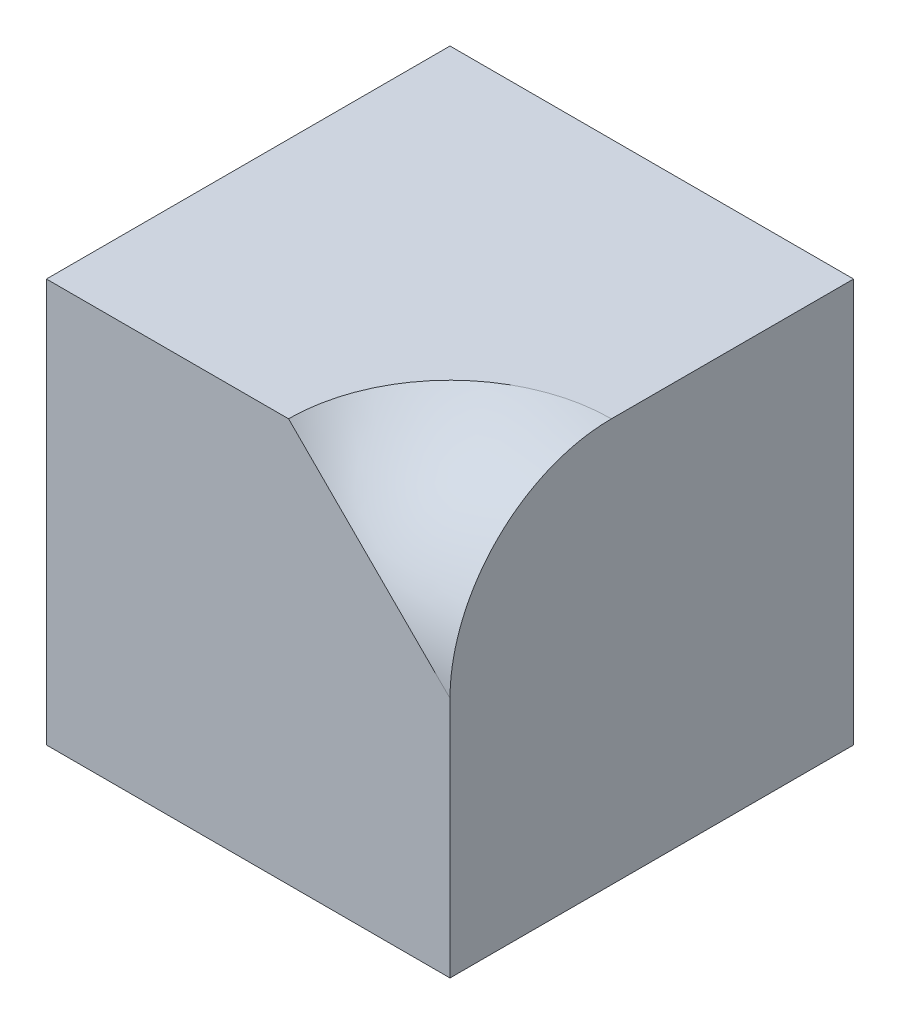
ISO-10303-21;
HEADER;
FILE_DESCRIPTION(('STEP AP214'),'2;1');
FILE_NAME('part.step','',(''),(''),'','','');
FILE_SCHEMA(('AUTOMOTIVE_DESIGN { 1 0 10303 214 1 1 1 1 }'));
ENDSEC;
DATA;
#1=APPLICATION_CONTEXT('core data for automotive mechanical design processes');
#2=APPLICATION_PROTOCOL_DEFINITION('international standard','automotive_design',2000,#1);
#3=PRODUCT_CONTEXT('',#1,'mechanical');
#4=PRODUCT('Part','Part','',(#3));
#5=PRODUCT_RELATED_PRODUCT_CATEGORY('part','',(#4));
#6=PRODUCT_DEFINITION_FORMATION('','',#4);
#7=PRODUCT_DEFINITION_CONTEXT('part definition',#1,'design');
#8=PRODUCT_DEFINITION('design','',#6,#7);
#9=PRODUCT_DEFINITION_SHAPE('','',#8);
#10=(LENGTH_UNIT() NAMED_UNIT(*) SI_UNIT(.MILLI.,.METRE.));
#11=(NAMED_UNIT(*) PLANE_ANGLE_UNIT() SI_UNIT($,.RADIAN.));
#12=(NAMED_UNIT(*) SI_UNIT($,.STERADIAN.) SOLID_ANGLE_UNIT());
#13=UNCERTAINTY_MEASURE_WITH_UNIT(LENGTH_MEASURE(1.E-05),#10,'distance_accuracy_value','');
#14=(GEOMETRIC_REPRESENTATION_CONTEXT(3) GLOBAL_UNCERTAINTY_ASSIGNED_CONTEXT((#13)) GLOBAL_UNIT_ASSIGNED_CONTEXT((#10,
#11,#12)) REPRESENTATION_CONTEXT('',''));
#15=CARTESIAN_POINT('',(0.,0.,0.));
#16=DIRECTION('',(0.,0.,1.));
#17=DIRECTION('',(1.,0.,0.));
#18=AXIS2_PLACEMENT_3D('',#15,#16,#17);
#19=CARTESIAN_POINT('',(50.,100.,50.));
#20=DIRECTION('',(-1.,0.,0.));
#21=DIRECTION('',(0.,0.,1.));
#22=AXIS2_PLACEMENT_3D('',#19,#20,#21);
#23=PLANE('',#22);
#24=CARTESIAN_POINT('',(50.0001212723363,100.000000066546,10.0985444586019));
#25=CARTESIAN_POINT('',(50.0001225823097,100.000006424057,10.0964960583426));
#26=CARTESIAN_POINT('',(50.0001238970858,100.000012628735,10.094447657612));
#27=CARTESIAN_POINT('',(50.000126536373,100.000024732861,10.0903507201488));
#28=CARTESIAN_POINT('',(50.0001278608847,100.00003063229,10.0883021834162));
#29=CARTESIAN_POINT('',(50.0001305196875,100.000042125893,10.0842049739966));
#30=CARTESIAN_POINT('',(50.0001318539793,100.000047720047,10.0821563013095));
#31=CARTESIAN_POINT('',(50.0001345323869,100.000058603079,10.0780588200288));
#32=CARTESIAN_POINT('',(50.0001358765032,100.000063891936,10.076010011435));
#33=CARTESIAN_POINT('',(50.0001385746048,100.000074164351,10.071912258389));
#34=CARTESIAN_POINT('',(50.0001399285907,100.000079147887,10.0698633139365));
#35=CARTESIAN_POINT('',(50.000142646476,100.000088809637,10.0657652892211));
#36=CARTESIAN_POINT('',(50.0001440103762,100.000093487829,10.0637162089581));
#37=CARTESIAN_POINT('',(50.0001467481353,100.000102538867,10.0596179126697));
#38=CARTESIAN_POINT('',(50.0001481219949,100.000106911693,10.0575686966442));
#39=CARTESIAN_POINT('',(50.0001508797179,100.000115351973,10.0534701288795));
#40=CARTESIAN_POINT('',(50.0001522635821,100.000119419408,10.0514207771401));
#41=CARTESIAN_POINT('',(50.0001550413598,100.000127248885,10.0473219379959));
#42=CARTESIAN_POINT('',(50.000156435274,100.000131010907,10.0452724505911));
#43=CARTESIAN_POINT('',(50.0001592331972,100.000138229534,10.0411733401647));
#44=CARTESIAN_POINT('',(50.0001606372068,100.00014168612,10.0391237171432));
#45=CARTESIAN_POINT('',(50.0001634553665,100.000148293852,10.0350243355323));
#46=CARTESIAN_POINT('',(50.0001648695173,100.000151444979,10.0329745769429));
#47=CARTESIAN_POINT('',(50.0001677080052,100.000157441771,10.0288749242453));
#48=CARTESIAN_POINT('',(50.0001691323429,100.000160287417,10.026825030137));
#49=CARTESIAN_POINT('',(50.0001719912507,100.000165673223,10.0227251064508));
#50=CARTESIAN_POINT('',(50.0001734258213,100.000168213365,10.0206750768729));
#51=CARTESIAN_POINT('',(50.000176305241,100.000172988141,10.0165748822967));
#52=CARTESIAN_POINT('',(50.0001777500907,100.000175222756,10.0145247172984));
#53=CARTESIAN_POINT('',(50.0001806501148,100.000179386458,10.010424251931));
#54=CARTESIAN_POINT('',(50.0001821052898,100.000181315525,10.0083739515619));
#55=CARTESIAN_POINT('',(50.0001850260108,100.000184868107,10.0042732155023));
#56=CARTESIAN_POINT('',(50.0001864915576,100.000186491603,10.002222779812));
#57=CARTESIAN_POINT('',(50.0001879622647,100.000187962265,10.0001723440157));
#58=B_SPLINE_CURVE_WITH_KNOTS('',3,(#24,#25,#26,#27,#28,#29,#30,#31,#32,#33,#34,#35,#36,#37,#38,
#39,#40,#41,#42,#43,#44,#45,#46,#47,#48,#49,#50,#51,#52,#53,#54,#55,#56,#57),.UNSPECIFIED.,.F.,
.F.,(4,2,2,2,2,2,2,2,2,2,2,2,2,2,2,2,4),(0.,0.00614523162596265,0.0122908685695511,
0.0184369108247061,0.024583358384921,0.0307302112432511,0.036877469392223,0.0430251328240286,
0.0491732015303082,0.0553216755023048,0.0614705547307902,0.0676198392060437,0.0737695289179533,
0.0799196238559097,0.0860701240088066,0.0922210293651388,0.0983723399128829),.UNSPECIFIED.);
#59=CARTESIAN_POINT('',(50.0000606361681,99.999939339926,10.0985442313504));
#60=VERTEX_POINT('',#59);
#61=CARTESIAN_POINT('',(50.0000469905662,100.000046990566,10.0000430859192));
#62=VERTEX_POINT('',#61);
#63=EDGE_CURVE('E63',#60,#62,#58,.T.);
#64=ORIENTED_EDGE('',*,*,#63,.F.);
#65=CARTESIAN_POINT('',(50.0001750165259,60.1134886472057,49.9999998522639));
#66=CARTESIAN_POINT('',(49.999757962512,60.4900635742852,49.9985452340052));
#67=CARTESIAN_POINT('',(49.9995670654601,60.8666238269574,49.9919720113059));
#68=CARTESIAN_POINT('',(49.9994404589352,61.6145533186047,49.9685831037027));
#69=CARTESIAN_POINT('',(49.9995014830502,61.9859267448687,49.9519009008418));
#70=CARTESIAN_POINT('',(49.9996798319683,62.7232853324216,49.9085389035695));
#71=CARTESIAN_POINT('',(49.999796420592,63.0892782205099,49.8819908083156));
#72=CARTESIAN_POINT('',(50.0000135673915,63.8157875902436,49.8192273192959));
#73=CARTESIAN_POINT('',(50.0001143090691,64.1763149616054,49.7831379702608));
#74=CARTESIAN_POINT('',(50.0002706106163,64.8918760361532,49.7016373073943));
#75=CARTESIAN_POINT('',(50.0003267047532,65.24692325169,49.6563446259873));
#76=CARTESIAN_POINT('',(50.0003942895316,65.951547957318,49.556784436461));
#77=CARTESIAN_POINT('',(50.0004062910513,66.3011410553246,49.5026273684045));
#78=CARTESIAN_POINT('',(50.0003974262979,66.9949040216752,49.3856718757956));
#79=CARTESIAN_POINT('',(50.0003769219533,67.3390911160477,49.3229756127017));
#80=CARTESIAN_POINT('',(50.0003177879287,68.0220987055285,49.1892553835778));
#81=CARTESIAN_POINT('',(50.0002793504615,68.3609376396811,49.1183255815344));
#82=CARTESIAN_POINT('',(50.0001972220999,69.0333077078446,48.9684292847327));
#83=CARTESIAN_POINT('',(50.0001535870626,69.3668581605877,48.889549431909));
#84=CARTESIAN_POINT('',(50.0000701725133,70.0287070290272,48.7240213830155));
#85=CARTESIAN_POINT('',(50.0000303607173,70.3570253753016,48.6374528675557));
#86=CARTESIAN_POINT('',(49.9999596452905,71.0084592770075,48.4567946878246));
#87=CARTESIAN_POINT('',(49.9999286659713,71.3315951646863,48.3627783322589));
#88=CARTESIAN_POINT('',(49.9998772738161,71.9727044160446,48.1674529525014));
#89=CARTESIAN_POINT('',(49.9998567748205,72.2906983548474,48.0662114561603));
#90=CARTESIAN_POINT('',(49.99982595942,72.9215531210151,47.8566485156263));
#91=CARTESIAN_POINT('',(49.9998155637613,73.2344346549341,47.7483894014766));
#92=CARTESIAN_POINT('',(49.9998036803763,73.8550816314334,47.5249914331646));
#93=CARTESIAN_POINT('',(49.9998021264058,74.162867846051,47.4099102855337));
#94=CARTESIAN_POINT('',(49.9998090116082,74.7733279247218,47.1730591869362));
#95=CARTESIAN_POINT('',(49.99981737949,75.0760226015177,47.0513428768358));
#96=CARTESIAN_POINT('',(49.9998427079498,75.6763010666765,46.8014015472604));
#97=CARTESIAN_POINT('',(49.999859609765,75.973905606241,46.6732263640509));
#98=CARTESIAN_POINT('',(49.99989650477,76.5640132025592,46.4105333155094));
#99=CARTESIAN_POINT('',(49.9999164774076,76.8565367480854,46.2760614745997));
#100=CARTESIAN_POINT('',(49.9999558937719,77.4364944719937,46.0009292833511));
#101=CARTESIAN_POINT('',(49.9999753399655,77.7239487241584,45.8603112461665));
#102=CARTESIAN_POINT('',(50.0000106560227,78.2937816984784,45.5730298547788));
#103=CARTESIAN_POINT('',(50.0000265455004,78.5761799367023,45.4264052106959));
#104=CARTESIAN_POINT('',(50.0000526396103,79.1359157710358,45.1272435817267));
#105=CARTESIAN_POINT('',(50.000062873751,79.4132721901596,44.9747418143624));
#106=CARTESIAN_POINT('',(50.0000764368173,79.9629396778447,44.6639494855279));
#107=CARTESIAN_POINT('',(50.0000797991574,80.2352687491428,44.5056907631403));
#108=CARTESIAN_POINT('',(50.0000793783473,80.7748966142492,44.1834994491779));
#109=CARTESIAN_POINT('',(50.000075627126,81.0422124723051,44.0195954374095));
#110=CARTESIAN_POINT('',(50.000061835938,81.571828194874,43.6862207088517));
#111=CARTESIAN_POINT('',(50.0000518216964,81.8341440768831,43.5167754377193));
#112=CARTESIAN_POINT('',(50.0000275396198,82.353772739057,43.1724184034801));
#113=CARTESIAN_POINT('',(50.0000132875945,82.6111003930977,42.9975290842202));
#114=CARTESIAN_POINT('',(49.9999841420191,83.120763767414,42.6423783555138));
#115=CARTESIAN_POINT('',(49.9999692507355,83.3731131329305,42.4621365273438));
#116=CARTESIAN_POINT('',(49.9999433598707,83.8728281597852,42.0963694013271));
#117=CARTESIAN_POINT('',(49.99993234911,84.120206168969,41.9108609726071));
#118=CARTESIAN_POINT('',(49.999923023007,84.6099858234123,41.5346477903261));
#119=CARTESIAN_POINT('',(49.9999246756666,84.8523984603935,41.3439573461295));
#120=CARTESIAN_POINT('',(49.9999388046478,85.3322393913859,40.9574518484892));
#121=CARTESIAN_POINT('',(49.9999512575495,85.5696773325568,40.7616487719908));
#122=CARTESIAN_POINT('',(49.999978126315,86.0395478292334,40.3649789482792));
#123=CARTESIAN_POINT('',(49.9999925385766,86.2719886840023,40.1641220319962));
#124=CARTESIAN_POINT('',(50.0000189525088,86.7318412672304,39.7574063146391));
#125=CARTESIAN_POINT('',(50.0000309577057,86.9592599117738,39.5515553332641));
#126=CARTESIAN_POINT('',(50.0000499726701,87.4090389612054,39.1349122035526));
#127=CARTESIAN_POINT('',(50.0000569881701,87.6314048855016,38.9241260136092));
#128=CARTESIAN_POINT('',(50.0000670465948,88.0710442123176,38.4976738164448));
#129=CARTESIAN_POINT('',(50.0000700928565,88.2883217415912,38.2820120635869));
#130=CARTESIAN_POINT('',(50.0000734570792,88.7177472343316,37.8458683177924));
#131=CARTESIAN_POINT('',(50.0000737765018,88.9298978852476,37.6253889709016));
#132=CARTESIAN_POINT('',(50.0000694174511,89.3490338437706,37.1796632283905));
#133=CARTESIAN_POINT('',(50.0000647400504,89.5560202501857,36.9544178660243));
#134=CARTESIAN_POINT('',(50.0000508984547,89.9647910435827,36.4992084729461));
#135=CARTESIAN_POINT('',(50.0000417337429,90.1665748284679,36.2692439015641));
#136=CARTESIAN_POINT('',(50.0000205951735,90.5649017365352,35.8046398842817));
#137=CARTESIAN_POINT('',(50.0000086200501,90.7614424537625,35.5699983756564));
#138=CARTESIAN_POINT('',(49.9999845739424,91.1492417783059,35.0960796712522));
#139=CARTESIAN_POINT('',(49.9999725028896,91.3404960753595,34.8567989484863));
#140=CARTESIAN_POINT('',(49.9999515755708,91.7176775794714,34.3736364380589));
#141=CARTESIAN_POINT('',(49.999942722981,91.9035984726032,34.1297497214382));
#142=CARTESIAN_POINT('',(49.9999312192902,92.2700632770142,33.6374048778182));
#143=CARTESIAN_POINT('',(49.9999285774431,92.4505987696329,33.388940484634));
#144=CARTESIAN_POINT('',(49.9999331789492,92.806238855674,32.8874659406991));
#145=CARTESIAN_POINT('',(49.9999404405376,92.9813328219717,32.6344482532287));
#146=CARTESIAN_POINT('',(49.9999595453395,93.3260213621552,32.1238809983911));
#147=CARTESIAN_POINT('',(49.9999713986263,93.4956029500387,31.8663226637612));
#148=CARTESIAN_POINT('',(49.9999938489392,93.829192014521,31.3466840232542));
#149=CARTESIAN_POINT('',(50.000004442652,93.9931840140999,31.0845937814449));
#150=CARTESIAN_POINT('',(50.0000220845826,94.3155167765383,30.5559011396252));
#151=CARTESIAN_POINT('',(50.0000291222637,94.4738394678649,30.289287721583));
#152=CARTESIAN_POINT('',(50.000038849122,94.7847514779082,29.7515571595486));
#153=CARTESIAN_POINT('',(50.0000415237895,94.9373200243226,29.4804280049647));
#154=CARTESIAN_POINT('',(50.0000428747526,95.2366359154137,28.9336730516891));
#155=CARTESIAN_POINT('',(50.0000415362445,95.3833596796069,28.6580343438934));
#156=CARTESIAN_POINT('',(50.0000357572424,95.6708914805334,28.1022658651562));
#157=CARTESIAN_POINT('',(50.0000313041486,95.8116730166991,27.822122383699));
#158=CARTESIAN_POINT('',(50.0000203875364,96.0872184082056,27.2573485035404));
#159=CARTESIAN_POINT('',(50.0000139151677,96.2219527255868,26.972703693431));
#160=CARTESIAN_POINT('',(49.9999999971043,96.4852936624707,26.3989300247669));
#161=CARTESIAN_POINT('',(49.9999925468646,96.6138675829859,26.1097861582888));
#162=CARTESIAN_POINT('',(49.9999774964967,96.8647691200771,25.5270162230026));
#163=CARTESIAN_POINT('',(49.9999698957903,96.98706074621,25.2333746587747));
#164=CARTESIAN_POINT('',(49.9999551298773,97.2252700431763,24.6416104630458));
#165=CARTESIAN_POINT('',(49.9999479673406,97.3411482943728,24.3434719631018));
#166=CARTESIAN_POINT('',(49.9999341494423,97.5663934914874,23.7427151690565));
#167=CARTESIAN_POINT('',(49.9999274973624,97.6757174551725,23.440080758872));
#168=CARTESIAN_POINT('',(49.9999151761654,97.8877044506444,22.8303403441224));
#169=CARTESIAN_POINT('',(49.9999095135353,97.990320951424,22.5232181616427));
#170=CARTESIAN_POINT('',(49.9999012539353,98.1887342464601,21.9045092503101));
#171=CARTESIAN_POINT('',(49.9998986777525,98.2844807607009,21.5929063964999));
#172=CARTESIAN_POINT('',(49.9998987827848,98.4689877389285,20.9652333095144));
#173=CARTESIAN_POINT('',(49.9999015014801,98.557693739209,20.6491470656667));
#174=CARTESIAN_POINT('',(49.9999135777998,98.7279432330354,20.0124954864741));
#175=CARTESIAN_POINT('',(49.9999229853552,98.8094276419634,19.6919143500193));
#176=CARTESIAN_POINT('',(49.9999480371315,98.9650448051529,19.0462537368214));
#177=CARTESIAN_POINT('',(49.9999637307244,99.0391134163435,18.7211587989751));
#178=CARTESIAN_POINT('',(49.9999984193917,99.179694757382,18.0664453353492));
#179=CARTESIAN_POINT('',(50.0000174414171,99.2461378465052,17.7368118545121));
#180=CARTESIAN_POINT('',(50.0000530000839,99.3712468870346,17.0729920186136));
#181=CARTESIAN_POINT('',(50.0000695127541,99.4298372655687,16.7387914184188));
#182=CARTESIAN_POINT('',(50.000091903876,99.5390014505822,16.0658068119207));
#183=CARTESIAN_POINT('',(50.0000976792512,99.5894933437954,15.7270095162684));
#184=CARTESIAN_POINT('',(50.0000902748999,99.6822034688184,15.0448040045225));
#185=CARTESIAN_POINT('',(50.0000769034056,99.7243331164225,14.7013837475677));
#186=CARTESIAN_POINT('',(50.0000268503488,99.8000464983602,14.0099146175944));
#187=CARTESIAN_POINT('',(49.9999899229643,99.8335348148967,13.6618552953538));
#188=CARTESIAN_POINT('',(49.9999030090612,99.8916868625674,12.9611106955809));
#189=CARTESIAN_POINT('',(49.9998528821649,99.9162485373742,12.6084169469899));
#190=CARTESIAN_POINT('',(49.9997722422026,99.956268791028,11.8984438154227));
#191=CARTESIAN_POINT('',(49.9997419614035,99.9716193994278,11.5411583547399));
#192=CARTESIAN_POINT('',(49.9998075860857,99.9929864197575,10.8221029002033));
#193=CARTESIAN_POINT('',(49.9999049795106,99.9988909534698,10.4603295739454));
#194=CARTESIAN_POINT('',(50.0001212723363,100.000000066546,10.0985444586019));
#195=B_SPLINE_CURVE_WITH_KNOTS('',3,(#65,#66,#67,#68,#69,#70,#71,#72,#73,#74,#75,#76,#77,#78,
#79,#80,#81,#82,#83,#84,#85,#86,#87,#88,#89,#90,#91,#92,#93,#94,#95,#96,#97,#98,#99,#100,#101,
#102,#103,#104,#105,#106,#107,#108,#109,#110,#111,#112,#113,#114,#115,#116,#117,#118,#119,#120,
#121,#122,#123,#124,#125,#126,#127,#128,#129,#130,#131,#132,#133,#134,#135,#136,#137,#138,#139,
#140,#141,#142,#143,#144,#145,#146,#147,#148,#149,#150,#151,#152,#153,#154,#155,#156,#157,#158,
#159,#160,#161,#162,#163,#164,#165,#166,#167,#168,#169,#170,#171,#172,#173,#174,#175,#176,#177,
#178,#179,#180,#181,#182,#183,#184,#185,#186,#187,#188,#189,#190,#191,#192,#193,#194),
.UNSPECIFIED.,.F.,.F.,(4,2,2,2,2,2,2,2,2,2,2,2,2,2,2,2,2,2,2,2,2,2,2,2,2,2,2,2,2,2,2,2,2,2,2,2,
2,2,2,2,2,2,2,2,2,2,2,2,2,2,2,2,2,2,2,2,2,2,2,2,2,2,2,2,4),(0.,1.1297060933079,2.24481072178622,
3.34553540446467,4.43238861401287,5.50603197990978,6.56719565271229,7.61662680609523,
8.65505951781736,9.68319779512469,10.7017062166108,11.7112046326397,12.7122647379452,
13.7054072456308,14.6910989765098,15.6697509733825,16.6417542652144,17.6075146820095,
18.5674383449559,19.5219302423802,20.4713935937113,21.4162290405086,22.3568336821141,
23.2935999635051,24.22691441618,25.1571562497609,26.0846957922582,27.0098924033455,
27.9330877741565,28.8546082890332,29.774768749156,30.6938703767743,31.6121988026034,
32.5300349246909,33.4476740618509,34.3654189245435,35.2835779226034,36.2024646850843,
37.122397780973,38.0437006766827,38.9667022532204,39.8917403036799,40.8191602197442,
41.7493122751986,42.6825513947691,43.6192372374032,44.5597344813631,45.5044132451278,
46.453649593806,47.4078261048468,48.3673324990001,49.3325646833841,50.3039052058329,
51.2817515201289,52.2665447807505,53.2587675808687,54.2589413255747,55.2676238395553,
56.2854066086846,57.3129104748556,58.350777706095,59.3996570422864,60.4601764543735,
61.5328958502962,62.6182287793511),.UNSPECIFIED.);
#196=CARTESIAN_POINT('',(50.0000437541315,60.1135066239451,49.9999597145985));
#197=VERTEX_POINT('',#196);
#198=EDGE_CURVE('E112',#197,#60,#195,.T.);
#199=ORIENTED_EDGE('',*,*,#198,.F.);
#200=DIRECTION('',(0.,-1.,0.));
#201=VECTOR('',#200,1.);
#202=CARTESIAN_POINT('',(50.,100.,50.));
#203=LINE('',#202,#201);
#204=CARTESIAN_POINT('',(50.,0.,50.));
#205=VERTEX_POINT('',#204);
#206=EDGE_CURVE('E94',#197,#205,#203,.T.);
#207=ORIENTED_EDGE('',*,*,#206,.T.);
#208=DIRECTION('',(0.,0.,-1.));
#209=VECTOR('',#208,1.);
#210=CARTESIAN_POINT('',(50.,0.,50.));
#211=LINE('',#210,#209);
#212=CARTESIAN_POINT('',(50.,0.,-50.));
#213=VERTEX_POINT('',#212);
#214=EDGE_CURVE('E120',#205,#213,#211,.T.);
#215=ORIENTED_EDGE('',*,*,#214,.T.);
#216=DIRECTION('',(0.,-1.,0.));
#217=VECTOR('',#216,1.);
#218=CARTESIAN_POINT('',(50.,100.,-50.));
#219=LINE('',#218,#217);
#220=CARTESIAN_POINT('',(50.,100.,-50.));
#221=VERTEX_POINT('',#220);
#222=EDGE_CURVE('E12',#221,#213,#219,.T.);
#223=ORIENTED_EDGE('',*,*,#222,.F.);
#224=DIRECTION('',(0.,0.,-1.));
#225=VECTOR('',#224,1.);
#226=CARTESIAN_POINT('',(50.,100.,50.));
#227=LINE('',#226,#225);
#228=EDGE_CURVE('E98',#62,#221,#227,.T.);
#229=ORIENTED_EDGE('',*,*,#228,.F.);
#230=EDGE_LOOP('',(#64,#199,#207,#215,#223,#229));
#231=FACE_BOUND('',#230,.T.);
#232=ADVANCED_FACE('F45',(#231),#23,.F.);
#233=CARTESIAN_POINT('',(-50.,100.,-50.));
#234=DIRECTION('',(0.,0.,1.));
#235=DIRECTION('',(1.,0.,0.));
#236=AXIS2_PLACEMENT_3D('',#233,#234,#235);
#237=PLANE('',#236);
#238=DIRECTION('',(-1.,0.,0.));
#239=VECTOR('',#238,1.);
#240=CARTESIAN_POINT('',(-50.,0.,-50.));
#241=LINE('',#240,#239);
#242=CARTESIAN_POINT('',(-50.,0.,-50.));
#243=VERTEX_POINT('',#242);
#244=EDGE_CURVE('E136',#213,#243,#241,.T.);
#245=ORIENTED_EDGE('',*,*,#244,.T.);
#246=DIRECTION('',(0.,-1.,0.));
#247=VECTOR('',#246,1.);
#248=CARTESIAN_POINT('',(-50.,100.,-50.));
#249=LINE('',#248,#247);
#250=CARTESIAN_POINT('',(-50.,100.,-50.));
#251=VERTEX_POINT('',#250);
#252=EDGE_CURVE('E55',#251,#243,#249,.T.);
#253=ORIENTED_EDGE('',*,*,#252,.F.);
#254=DIRECTION('',(-1.,0.,0.));
#255=VECTOR('',#254,1.);
#256=CARTESIAN_POINT('',(-50.,100.,-50.));
#257=LINE('',#256,#255);
#258=EDGE_CURVE('E126',#221,#251,#257,.T.);
#259=ORIENTED_EDGE('',*,*,#258,.F.);
#260=ORIENTED_EDGE('',*,*,#222,.T.);
#261=EDGE_LOOP('',(#245,#253,#259,#260));
#262=FACE_BOUND('',#261,.T.);
#263=ADVANCED_FACE('F206',(#262),#237,.F.);
#264=CARTESIAN_POINT('',(-50.,100.,50.));
#265=DIRECTION('',(1.,0.,0.));
#266=DIRECTION('',(0.,0.,-1.));
#267=AXIS2_PLACEMENT_3D('',#264,#265,#266);
#268=PLANE('',#267);
#269=DIRECTION('',(0.,0.,1.));
#270=VECTOR('',#269,1.);
#271=CARTESIAN_POINT('',(-50.,0.,50.));
#272=LINE('',#271,#270);
#273=CARTESIAN_POINT('',(-50.,0.,50.));
#274=VERTEX_POINT('',#273);
#275=EDGE_CURVE('E138',#243,#274,#272,.T.);
#276=ORIENTED_EDGE('',*,*,#275,.T.);
#277=DIRECTION('',(0.,-1.,0.));
#278=VECTOR('',#277,1.);
#279=CARTESIAN_POINT('',(-50.,100.,50.));
#280=LINE('',#279,#278);
#281=CARTESIAN_POINT('',(-50.,100.,50.));
#282=VERTEX_POINT('',#281);
#283=EDGE_CURVE('E124',#282,#274,#280,.T.);
#284=ORIENTED_EDGE('',*,*,#283,.F.);
#285=DIRECTION('',(0.,0.,1.));
#286=VECTOR('',#285,1.);
#287=CARTESIAN_POINT('',(-50.,100.,50.));
#288=LINE('',#287,#286);
#289=EDGE_CURVE('E73',#251,#282,#288,.T.);
#290=ORIENTED_EDGE('',*,*,#289,.F.);
#291=ORIENTED_EDGE('',*,*,#252,.T.);
#292=EDGE_LOOP('',(#276,#284,#290,#291));
#293=FACE_BOUND('',#292,.T.);
#294=ADVANCED_FACE('F210',(#293),#268,.F.);
#295=CARTESIAN_POINT('',(-50.,100.,50.));
#296=DIRECTION('',(0.,0.,-1.));
#297=DIRECTION('',(-1.,0.,0.));
#298=AXIS2_PLACEMENT_3D('',#295,#296,#297);
#299=PLANE('',#298);
#300=DIRECTION('',(1.,0.,0.));
#301=VECTOR('',#300,1.);
#302=CARTESIAN_POINT('',(-50.,0.,50.));
#303=LINE('',#302,#301);
#304=EDGE_CURVE('E140',#274,#205,#303,.T.);
#305=ORIENTED_EDGE('',*,*,#304,.T.);
#306=ORIENTED_EDGE('',*,*,#206,.F.);
#307=CARTESIAN_POINT('',(9.99886255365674,100.,50.));
#308=CARTESIAN_POINT('',(10.3890197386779,99.6105204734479,50.));
#309=CARTESIAN_POINT('',(10.7789745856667,99.2208385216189,50.));
#310=CARTESIAN_POINT('',(11.5587063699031,98.4412966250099,50.));
#311=CARTESIAN_POINT('',(11.9484833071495,98.0514366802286,50.));
#312=CARTESIAN_POINT('',(12.7280859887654,97.2717657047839,50.));
#313=CARTESIAN_POINT('',(13.1179117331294,96.881954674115,50.));
#314=CARTESIAN_POINT('',(13.8976235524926,96.102392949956,50.));
#315=CARTESIAN_POINT('',(14.2875096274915,95.7126422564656,50.));
#316=CARTESIAN_POINT('',(15.0671951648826,94.9330323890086,50.));
#317=CARTESIAN_POINT('',(15.4569946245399,94.5431732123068,50.));
#318=CARTESIAN_POINT('',(16.2365563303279,93.7634176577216,50.));
#319=CARTESIAN_POINT('',(16.6263185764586,93.3735212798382,50.));
#320=CARTESIAN_POINT('',(17.4059259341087,92.5938113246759,50.));
#321=CARTESIAN_POINT('',(17.7957710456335,92.2039977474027,50.));
#322=CARTESIAN_POINT('',(18.5754497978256,91.4243591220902,50.));
#323=CARTESIAN_POINT('',(18.9652834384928,91.034534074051,50.));
#324=CARTESIAN_POINT('',(20.1347737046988,89.8650485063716,50.));
#325=CARTESIAN_POINT('',(20.9144197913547,89.0853774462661,50.));
#326=CARTESIAN_POINT('',(22.4737724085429,87.5260960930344,50.));
#327=CARTESIAN_POINT('',(23.2534789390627,86.7464857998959,50.));
#328=CARTESIAN_POINT('',(24.8128556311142,85.1872730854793,50.));
#329=CARTESIAN_POINT('',(25.5925257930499,84.4076706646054,50.));
#330=CARTESIAN_POINT('',(27.151752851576,82.8483514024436,50.));
#331=CARTESIAN_POINT('',(27.9313097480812,82.0686345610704,50.));
#332=CARTESIAN_POINT('',(29.2660367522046,80.7337309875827,50.));
#333=CARTESIAN_POINT('',(29.8211928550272,80.1785302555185,50.));
#334=CARTESIAN_POINT('',(30.9316230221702,79.0682476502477,50.));
#335=CARTESIAN_POINT('',(31.4868970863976,78.5131657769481,50.));
#336=CARTESIAN_POINT('',(32.5974335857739,77.4029937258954,50.));
#337=CARTESIAN_POINT('',(33.1526960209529,76.8479035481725,50.));
#338=CARTESIAN_POINT('',(34.2629788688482,75.7373894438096,50.));
#339=CARTESIAN_POINT('',(34.8179992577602,75.1819654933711,50.));
#340=CARTESIAN_POINT('',(35.9281330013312,74.0712071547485,50.));
#341=CARTESIAN_POINT('',(36.4832463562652,73.515872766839,50.));
#342=CARTESIAN_POINT('',(37.593775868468,72.4054941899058,50.));
#343=CARTESIAN_POINT('',(38.1491920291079,71.8504500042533,50.));
#344=CARTESIAN_POINT('',(39.1129074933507,70.8876245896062,50.));
#345=CARTESIAN_POINT('',(39.5211743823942,70.4798109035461,50.));
#346=CARTESIAN_POINT('',(40.3376142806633,69.6640918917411,50.));
#347=CARTESIAN_POINT('',(40.7457872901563,69.2561865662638,50.));
#348=CARTESIAN_POINT('',(41.5618723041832,68.4401312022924,50.));
#349=CARTESIAN_POINT('',(41.9697843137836,68.031981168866,50.));
#350=CARTESIAN_POINT('',(42.7852909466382,67.2153942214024,50.));
#351=CARTESIAN_POINT('',(43.1928855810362,66.8069573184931,50.));
#352=CARTESIAN_POINT('',(44.0077972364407,65.9900877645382,50.));
#353=CARTESIAN_POINT('',(44.41511430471,65.5816551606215,50.));
#354=CARTESIAN_POINT('',(45.2300277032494,64.765061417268,50.));
#355=CARTESIAN_POINT('',(45.6376240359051,64.3569002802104,50.));
#356=CARTESIAN_POINT('',(46.4536919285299,63.5413937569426,50.));
#357=CARTESIAN_POINT('',(46.8621635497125,63.1340484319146,50.));
#358=CARTESIAN_POINT('',(47.4758970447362,62.5240036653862,50.));
#359=CARTESIAN_POINT('',(47.6806607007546,62.3208029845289,50.));
#360=CARTESIAN_POINT('',(48.0905555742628,61.9147727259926,50.));
#361=CARTESIAN_POINT('',(48.2956867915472,61.7119431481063,50.));
#362=CARTESIAN_POINT('',(48.5821188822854,61.4294233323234,50.));
#363=CARTESIAN_POINT('',(48.6632086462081,61.3495190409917,50.));
#364=CARTESIAN_POINT('',(48.8254840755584,61.1898291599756,50.));
#365=CARTESIAN_POINT('',(48.9066697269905,61.1100435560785,50.));
#366=CARTESIAN_POINT('',(49.028567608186,60.9905072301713,50.));
#367=CARTESIAN_POINT('',(49.0692150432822,60.9506904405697,50.));
#368=CARTESIAN_POINT('',(49.1505669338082,60.8711225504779,50.));
#369=CARTESIAN_POINT('',(49.1912713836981,60.8313714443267,50.));
#370=CARTESIAN_POINT('',(49.2727958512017,60.7519349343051,50.));
#371=CARTESIAN_POINT('',(49.3136159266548,60.7122495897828,50.));
#372=CARTESIAN_POINT('',(49.3954089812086,60.6330096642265,50.));
#373=CARTESIAN_POINT('',(49.4363820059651,60.5934551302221,50.));
#374=CARTESIAN_POINT('',(49.4980347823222,60.5343058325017,50.));
#375=CARTESIAN_POINT('',(49.5186226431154,60.5146153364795,50.));
#376=CARTESIAN_POINT('',(49.5598812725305,60.4753269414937,50.));
#377=CARTESIAN_POINT('',(49.5805520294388,60.4557290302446,50.));
#378=CARTESIAN_POINT('',(49.6219908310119,60.4166849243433,50.));
#379=CARTESIAN_POINT('',(49.6427587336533,60.3972385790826,50.));
#380=CARTESIAN_POINT('',(49.6844844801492,60.3585292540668,50.));
#381=CARTESIAN_POINT('',(49.7054424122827,60.3392663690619,50.));
#382=CARTESIAN_POINT('',(49.7477334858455,60.3009686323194,50.));
#383=CARTESIAN_POINT('',(49.7690678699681,60.2819351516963,50.));
#384=CARTESIAN_POINT('',(49.8121814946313,60.2444307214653,50.));
#385=CARTESIAN_POINT('',(49.8339600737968,60.2259590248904,50.));
#386=CARTESIAN_POINT('',(49.8673455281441,60.1990275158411,50.));
#387=CARTESIAN_POINT('',(49.8786209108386,60.1901598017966,50.));
#388=CARTESIAN_POINT('',(49.9014834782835,60.1728584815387,50.));
#389=CARTESIAN_POINT('',(49.9130703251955,60.1644244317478,50.));
#390=CARTESIAN_POINT('',(49.9367706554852,60.1481818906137,50.));
#391=CARTESIAN_POINT('',(49.9488864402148,60.1403766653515,50.));
#392=CARTESIAN_POINT('',(49.9675890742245,60.1295200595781,50.));
#393=CARTESIAN_POINT('',(49.9739229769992,60.1260377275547,50.));
#394=CARTESIAN_POINT('',(49.9867994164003,60.1194619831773,50.));
#395=CARTESIAN_POINT('',(49.9933422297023,60.1163691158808,50.));
#396=CARTESIAN_POINT('',(50.0000000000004,60.1135254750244,50.));
#397=B_SPLINE_CURVE_WITH_KNOTS('',3,(#307,#308,#309,#310,#311,#312,#313,#314,#315,#316,#317,
#318,#319,#320,#321,#322,#323,#324,#325,#326,#327,#328,#329,#330,#331,#332,#333,#334,#335,#336,
#337,#338,#339,#340,#341,#342,#343,#344,#345,#346,#347,#348,#349,#350,#351,#352,#353,#354,#355,
#356,#357,#358,#359,#360,#361,#362,#363,#364,#365,#366,#367,#368,#369,#370,#371,#372,#373,#374,
#375,#376,#377,#378,#379,#380,#381,#382,#383,#384,#385,#386,#387,#388,#389,#390,#391,#392,#393,
#394,#395,#396),.UNSPECIFIED.,.F.,.F.,(4,2,2,2,2,2,2,2,2,2,2,2,2,2,2,2,2,2,2,2,2,2,2,2,2,2,2,2,
2,2,2,2,2,2,2,2,2,2,2,2,2,2,2,2,4),(0.,1.6538595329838,3.30771907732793,4.96157843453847,
6.61543778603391,8.2693435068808,9.92324922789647,11.5771550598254,13.2310608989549,
16.5388720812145,19.8466825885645,23.1543992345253,26.4621183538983,28.8175408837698,
31.1729615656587,33.5283751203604,35.8839834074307,38.2395987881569,40.5952409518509,
42.3264095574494,44.0575731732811,45.7887020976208,47.5197672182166,49.2502352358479,
50.9807182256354,52.7113264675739,53.5767555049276,54.442184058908,54.7837132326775,
55.1251975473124,55.2958969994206,55.4665808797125,55.6373754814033,55.8082259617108,
55.8936902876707,55.9791429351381,56.06449566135,56.1498903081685,56.23565958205,
56.3213093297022,56.364336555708,56.40731885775,56.4505116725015,56.4721839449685,
56.4938862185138),.UNSPECIFIED.);
#398=CARTESIAN_POINT('',(9.99943127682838,100.,50.));
#399=VERTEX_POINT('',#398);
#400=EDGE_CURVE('E110',#399,#197,#397,.T.);
#401=ORIENTED_EDGE('',*,*,#400,.F.);
#402=DIRECTION('',(1.,0.,0.));
#403=VECTOR('',#402,1.);
#404=CARTESIAN_POINT('',(-50.,100.,50.));
#405=LINE('',#404,#403);
#406=EDGE_CURVE('E119',#282,#399,#405,.T.);
#407=ORIENTED_EDGE('',*,*,#406,.F.);
#408=ORIENTED_EDGE('',*,*,#283,.T.);
#409=EDGE_LOOP('',(#305,#306,#401,#407,#408));
#410=FACE_BOUND('',#409,.T.);
#411=ADVANCED_FACE('F117',(#410),#299,.F.);
#412=CARTESIAN_POINT('',(50.,100.,-50.));
#413=DIRECTION('',(0.,-1.,0.));
#414=DIRECTION('',(0.,0.,-1.));
#415=AXIS2_PLACEMENT_3D('',#412,#413,#414);
#416=PLANE('',#415);
#417=ORIENTED_EDGE('',*,*,#406,.T.);
#418=CARTESIAN_POINT('',(50.0001879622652,100.000187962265,10.0001723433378));
#419=CARTESIAN_POINT('',(49.621679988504,100.000072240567,10.0000647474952));
#420=CARTESIAN_POINT('',(49.2431718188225,100.000003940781,10.0053771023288));
#421=CARTESIAN_POINT('',(48.4916896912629,99.999928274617,10.0266490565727));
#422=CARTESIAN_POINT('',(48.1187115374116,99.9999200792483,10.0424605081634));
#423=CARTESIAN_POINT('',(47.3782799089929,99.9999293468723,10.0842610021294));
#424=CARTESIAN_POINT('',(47.0108186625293,99.9999464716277,10.1101125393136));
#425=CARTESIAN_POINT('',(46.2814026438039,99.9999855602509,10.1715654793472));
#426=CARTESIAN_POINT('',(45.9194371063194,100.000007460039,10.2070391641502));
#427=CARTESIAN_POINT('',(45.2009877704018,100.000044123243,10.28734629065));
#428=CARTESIAN_POINT('',(44.8444907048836,100.000058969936,10.3320610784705));
#429=CARTESIAN_POINT('',(44.1369478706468,100.000077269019,10.4304942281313));
#430=CARTESIAN_POINT('',(43.7858867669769,100.00008085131,10.4841023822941));
#431=CARTESIAN_POINT('',(43.0891807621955,100.000077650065,10.5999960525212));
#432=CARTESIAN_POINT('',(42.7435188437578,100.000070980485,10.6621792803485));
#433=CARTESIAN_POINT('',(42.0575724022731,100.000051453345,10.7949229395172));
#434=CARTESIAN_POINT('',(41.71726952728,100.000038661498,10.8653885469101));
#435=CARTESIAN_POINT('',(41.0419997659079,100.000012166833,11.0144191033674));
#436=CARTESIAN_POINT('',(40.7070135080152,99.9999984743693,11.0928962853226));
#437=CARTESIAN_POINT('',(40.042334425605,99.999974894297,11.2576910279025));
#438=CARTESIAN_POINT('',(39.7126214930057,99.9999649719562,11.3439274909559));
#439=CARTESIAN_POINT('',(39.0584473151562,99.9999519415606,11.5239978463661));
#440=CARTESIAN_POINT('',(38.7339654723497,99.9999487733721,11.6177569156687));
#441=CARTESIAN_POINT('',(38.0902150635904,99.9999500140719,11.8126432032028));
#442=CARTESIAN_POINT('',(37.7709256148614,99.9999543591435,11.9137014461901));
#443=CARTESIAN_POINT('',(37.1375280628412,99.999969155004,12.1229687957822));
#444=CARTESIAN_POINT('',(36.8233989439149,99.9999795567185,12.2311142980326));
#445=CARTESIAN_POINT('',(36.2003000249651,100.000003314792,12.4543491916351));
#446=CARTESIAN_POINT('',(35.8913091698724,100.000016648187,12.5693798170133));
#447=CARTESIAN_POINT('',(35.2784786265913,100.000041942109,12.8061886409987));
#448=CARTESIAN_POINT('',(34.9746178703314,100.000053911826,12.92791232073));
#449=CARTESIAN_POINT('',(34.3720417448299,100.000072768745,13.1779204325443));
#450=CARTESIAN_POINT('',(34.0733053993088,100.000079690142,13.3061543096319));
#451=CARTESIAN_POINT('',(33.4809624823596,100.000087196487,13.5690079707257));
#452=CARTESIAN_POINT('',(33.1873352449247,100.000087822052,13.7035811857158));
#453=CARTESIAN_POINT('',(32.605195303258,100.000083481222,13.9789546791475));
#454=CARTESIAN_POINT('',(32.3166623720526,100.000078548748,14.1197121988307));
#455=CARTESIAN_POINT('',(31.7446969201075,100.000066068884,14.4073092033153));
#456=CARTESIAN_POINT('',(31.4612447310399,100.000058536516,14.5541095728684));
#457=CARTESIAN_POINT('',(30.8994278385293,100.000045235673,14.8536597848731));
#458=CARTESIAN_POINT('',(30.621044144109,100.000039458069,15.0063740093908));
#459=CARTESIAN_POINT('',(30.0693515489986,100.000033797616,15.3176296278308));
#460=CARTESIAN_POINT('',(29.7960244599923,100.000033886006,15.4761387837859));
#461=CARTESIAN_POINT('',(29.2544309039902,100.000041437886,15.7988692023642));
#462=CARTESIAN_POINT('',(28.9861471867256,100.000048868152,15.9630615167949));
#463=CARTESIAN_POINT('',(28.4546221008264,100.000066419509,16.2970463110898));
#464=CARTESIAN_POINT('',(28.1913645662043,100.000076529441,16.4668130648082));
#465=CARTESIAN_POINT('',(27.6698686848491,100.000086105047,16.8118341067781));
#466=CARTESIAN_POINT('',(27.4116153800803,100.000085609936,16.9870657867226));
#467=CARTESIAN_POINT('',(26.9001263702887,100.000081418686,17.3429322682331));
#468=CARTESIAN_POINT('',(26.6468768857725,100.000077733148,17.5235472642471));
#469=CARTESIAN_POINT('',(26.1453952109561,100.000070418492,17.8900978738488));
#470=CARTESIAN_POINT('',(25.8971504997,100.00006678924,18.0760163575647));
#471=CARTESIAN_POINT('',(25.4056807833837,100.000061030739,18.4530957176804));
#472=CARTESIAN_POINT('',(25.1624445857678,100.000058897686,18.6442420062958));
#473=CARTESIAN_POINT('',(24.6809985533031,100.000056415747,19.0317028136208));
#474=CARTESIAN_POINT('',(24.4427789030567,100.000056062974,19.2280051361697));
#475=CARTESIAN_POINT('',(23.971378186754,100.000056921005,19.6257077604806));
#476=CARTESIAN_POINT('',(23.7381887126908,100.000058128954,19.8270980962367));
#477=CARTESIAN_POINT('',(23.2768671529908,100.000061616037,20.2349099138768));
#478=CARTESIAN_POINT('',(23.0487280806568,100.000063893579,20.4413234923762));
#479=CARTESIAN_POINT('',(22.5975333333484,100.000068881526,20.8591175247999));
#480=CARTESIAN_POINT('',(22.3744720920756,100.000071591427,21.0704919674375));
#481=CARTESIAN_POINT('',(21.9334672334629,100.000076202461,21.4981456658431));
#482=CARTESIAN_POINT('',(21.7155194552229,100.000078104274,21.7144206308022));
#483=CARTESIAN_POINT('',(21.2847793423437,100.000080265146,22.1518156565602));
#484=CARTESIAN_POINT('',(21.0719842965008,100.000080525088,22.3729330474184));
#485=CARTESIAN_POINT('',(20.6515844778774,100.000080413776,22.8199580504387));
#486=CARTESIAN_POINT('',(20.4439785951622,100.000080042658,23.0458646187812));
#487=CARTESIAN_POINT('',(20.0339949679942,100.000079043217,23.5024200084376));
#488=CARTESIAN_POINT('',(19.8316178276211,100.000078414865,23.7330693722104));
#489=CARTESIAN_POINT('',(19.4321325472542,100.000077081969,24.1990679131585));
#490=CARTESIAN_POINT('',(19.2350268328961,100.000076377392,24.434419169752));
#491=CARTESIAN_POINT('',(18.8461288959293,100.000074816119,24.9097844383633));
#492=CARTESIAN_POINT('',(18.6543410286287,100.000073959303,25.149802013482));
#493=CARTESIAN_POINT('',(18.2761273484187,100.000071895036,25.634467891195));
#494=CARTESIAN_POINT('',(18.0897079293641,100.000070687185,25.8791211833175));
#495=CARTESIAN_POINT('',(17.7222843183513,100.000067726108,26.3730312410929));
#496=CARTESIAN_POINT('',(17.5412886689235,100.000065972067,26.6222943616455));
#497=CARTESIAN_POINT('',(17.1847709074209,100.00006187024,27.1254013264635));
#498=CARTESIAN_POINT('',(17.0092595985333,100.000059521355,27.3792528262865));
#499=CARTESIAN_POINT('',(16.6637744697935,100.00005443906,27.8915180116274));
#500=CARTESIAN_POINT('',(16.4938138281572,100.000051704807,28.1499405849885));
#501=CARTESIAN_POINT('',(16.1595000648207,100.000046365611,28.6713332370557));
#502=CARTESIAN_POINT('',(15.9951626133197,100.000043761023,28.9343133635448));
#503=CARTESIAN_POINT('',(15.6721716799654,100.000039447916,29.4648098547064));
#504=CARTESIAN_POINT('',(15.5135364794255,100.000037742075,29.7323373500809));
#505=CARTESIAN_POINT('',(15.2020331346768,100.000036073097,30.271920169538));
#506=CARTESIAN_POINT('',(15.0491860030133,100.000036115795,30.5439876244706));
#507=CARTESIAN_POINT('',(14.7493486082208,100.000038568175,31.0926441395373));
#508=CARTESIAN_POINT('',(14.6023822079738,100.000040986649,31.3692462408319));
#509=CARTESIAN_POINT('',(14.3144028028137,100.000048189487,31.9269672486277));
#510=CARTESIAN_POINT('',(14.173416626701,100.000052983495,32.20810000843));
#511=CARTESIAN_POINT('',(13.8975008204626,100.000063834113,32.7748781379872));
#512=CARTESIAN_POINT('',(13.7626010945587,100.000069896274,33.0605380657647));
#513=CARTESIAN_POINT('',(13.4989680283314,100.00008073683,33.6363662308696));
#514=CARTESIAN_POINT('',(13.3702677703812,100.000085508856,33.9265496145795));
#515=CARTESIAN_POINT('',(13.1191500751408,100.000089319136,34.5114194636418));
#516=CARTESIAN_POINT('',(12.996768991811,100.000088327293,34.8061215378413));
#517=CARTESIAN_POINT('',(12.7584125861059,100.000074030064,35.4000229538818));
#518=CARTESIAN_POINT('',(12.6424769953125,100.00006065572,35.6992382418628));
#519=CARTESIAN_POINT('',(12.4171527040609,100.000023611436,36.3021668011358));
#520=CARTESIAN_POINT('',(12.3078073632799,99.9999998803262,36.6058962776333));
#521=CARTESIAN_POINT('',(12.0958260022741,99.9999524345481,37.217854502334));
#522=CARTESIAN_POINT('',(11.993237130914,99.9999287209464,37.526099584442));
#523=CARTESIAN_POINT('',(11.7949464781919,99.9998963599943,38.1470975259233));
#524=CARTESIAN_POINT('',(11.699296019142,99.9998878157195,38.4598667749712));
#525=CARTESIAN_POINT('',(11.5150662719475,99.9998993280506,39.0899297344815));
#526=CARTESIAN_POINT('',(11.4265429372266,99.9999195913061,39.4072398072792));
#527=CARTESIAN_POINT('',(11.2567499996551,99.9999910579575,40.0463982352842));
#528=CARTESIAN_POINT('',(11.1755411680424,100.000042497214,40.3682627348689));
#529=CARTESIAN_POINT('',(11.0205459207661,100.00015348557,41.0165263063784));
#530=CARTESIAN_POINT('',(10.9468248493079,100.000213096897,41.3429409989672));
#531=CARTESIAN_POINT('',(10.8069479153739,100.000280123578,42.0002794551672));
#532=CARTESIAN_POINT('',(10.7408614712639,100.00028709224,42.3312179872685));
#533=CARTESIAN_POINT('',(10.6164401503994,100.000216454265,42.9976035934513));
#534=CARTESIAN_POINT('',(10.5581796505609,100.000138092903,43.333064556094));
#535=CARTESIAN_POINT('',(10.4496762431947,99.999927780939,44.0085474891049));
#536=CARTESIAN_POINT('',(10.3995146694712,99.9997953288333,44.348582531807));
#537=CARTESIAN_POINT('',(10.3075518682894,99.9995672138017,45.033311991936));
#538=CARTESIAN_POINT('',(10.2658410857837,99.9994719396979,45.3780185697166));
#539=CARTESIAN_POINT('',(10.1911539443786,99.999421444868,46.0721878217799));
#540=CARTESIAN_POINT('',(10.158278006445,99.9994677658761,46.4216613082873));
#541=CARTESIAN_POINT('',(10.1015732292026,99.999720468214,47.1253780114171));
#542=CARTESIAN_POINT('',(10.0778525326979,99.9999286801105,47.4796299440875));
#543=CARTESIAN_POINT('',(10.0396273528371,100.000360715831,48.1927309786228));
#544=CARTESIAN_POINT('',(10.0252325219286,100.000584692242,48.5515859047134));
#545=CARTESIAN_POINT('',(10.0054948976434,100.000528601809,49.273453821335));
#546=CARTESIAN_POINT('',(10.0002522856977,100.000243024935,49.6364695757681));
#547=CARTESIAN_POINT('',(9.99943294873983,99.9994329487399,49.9994800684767));
#548=B_SPLINE_CURVE_WITH_KNOTS('',3,(#418,#419,#420,#421,#422,#423,#424,#425,#426,#427,#428,
#429,#430,#431,#432,#433,#434,#435,#436,#437,#438,#439,#440,#441,#442,#443,#444,#445,#446,#447,
#448,#449,#450,#451,#452,#453,#454,#455,#456,#457,#458,#459,#460,#461,#462,#463,#464,#465,#466,
#467,#468,#469,#470,#471,#472,#473,#474,#475,#476,#477,#478,#479,#480,#481,#482,#483,#484,#485,
#486,#487,#488,#489,#490,#491,#492,#493,#494,#495,#496,#497,#498,#499,#500,#501,#502,#503,#504,
#505,#506,#507,#508,#509,#510,#511,#512,#513,#514,#515,#516,#517,#518,#519,#520,#521,#522,#523,
#524,#525,#526,#527,#528,#529,#530,#531,#532,#533,#534,#535,#536,#537,#538,#539,#540,#541,#542,
#543,#544,#545,#546,#547),.UNSPECIFIED.,.F.,.F.,(4,2,2,2,2,2,2,2,2,2,2,2,2,2,2,2,2,2,2,2,2,2,2,
2,2,2,2,2,2,2,2,2,2,2,2,2,2,2,2,2,2,2,2,2,2,2,2,2,2,2,2,2,2,2,2,2,2,2,2,2,2,2,2,2,4),(0.,
1.13548299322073,2.25527484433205,3.36024253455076,4.45120631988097,5.52894733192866,
6.59421344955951,7.64772374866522,8.69017136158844,9.72222441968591,10.7445248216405,
11.7576847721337,12.7622812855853,13.7588490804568,14.7478724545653,15.7297780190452,
16.7049691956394,17.6738649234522,18.6368791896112,19.5944199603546,20.5468906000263,
21.4946917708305,22.4382233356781,23.3778856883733,24.314074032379,25.2471633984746,
26.1775202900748,27.105503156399,28.0314597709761,28.9557251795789,29.8786200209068,
30.8004490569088,31.7214999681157,32.6420552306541,33.5624118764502,34.4828743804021,
35.4037533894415,36.3253655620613,37.2480334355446,38.172085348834,39.0978554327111,
40.0256836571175,40.9559159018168,41.8889039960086,42.8250056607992,43.7645842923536,
44.7080085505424,45.6556517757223,46.6078913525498,47.5651079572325,48.5276876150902,
49.4960311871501,50.4705399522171,51.4516455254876,52.4398246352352,53.4355747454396,
54.4393784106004,55.4516902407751,56.4730290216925,57.5040602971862,58.5456026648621,
59.598525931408,60.6635313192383,61.74084196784,62.8298727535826),.UNSPECIFIED.);
#549=EDGE_CURVE('E106',#62,#399,#548,.T.);
#550=ORIENTED_EDGE('',*,*,#549,.F.);
#551=ORIENTED_EDGE('',*,*,#228,.T.);
#552=ORIENTED_EDGE('',*,*,#258,.T.);
#553=ORIENTED_EDGE('',*,*,#289,.T.);
#554=EDGE_LOOP('',(#417,#550,#551,#552,#553));
#555=FACE_BOUND('',#554,.T.);
#556=ADVANCED_FACE('F122',(#555),#416,.F.);
#557=CARTESIAN_POINT('',(50.,0.,-50.));
#558=DIRECTION('',(0.,-1.,0.));
#559=DIRECTION('',(0.,0.,-1.));
#560=AXIS2_PLACEMENT_3D('',#557,#558,#559);
#561=PLANE('',#560);
#562=ORIENTED_EDGE('',*,*,#214,.F.);
#563=ORIENTED_EDGE('',*,*,#304,.F.);
#564=ORIENTED_EDGE('',*,*,#275,.F.);
#565=ORIENTED_EDGE('',*,*,#244,.F.);
#566=EDGE_LOOP('',(#562,#563,#564,#565));
#567=FACE_BOUND('',#566,.T.);
#568=ADVANCED_FACE('F174',(#567),#561,.T.);
#569=CARTESIAN_POINT('',(50.1829326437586,59.1754442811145,49.9935061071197));
#570=CARTESIAN_POINT('',(44.860947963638,58.9921735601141,49.9724868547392));
#571=CARTESIAN_POINT('',(40.3820154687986,59.6519550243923,50.724465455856));
#572=CARTESIAN_POINT('',(36.5740108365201,60.9826643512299,52.0916204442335));
#573=CARTESIAN_POINT('',(30.0633288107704,64.3456541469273,55.4576519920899));
#574=CARTESIAN_POINT('',(24.9783877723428,69.1343849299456,60.1309510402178));
#575=CARTESIAN_POINT('',(22.7272595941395,71.6182146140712,62.5438548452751));
#576=CARTESIAN_POINT('',(19.5618252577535,75.5490995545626,66.3511295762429));
#577=CARTESIAN_POINT('',(16.7627897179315,79.8463832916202,70.4943568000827));
#578=CARTESIAN_POINT('',(15.8747626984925,81.3197176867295,71.912823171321));
#579=CARTESIAN_POINT('',(15.0383512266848,82.8446676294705,73.378616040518));
#580=CARTESIAN_POINT('',(14.2547578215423,84.422435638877,74.8928380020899));
#581=CARTESIAN_POINT('',(53.9948627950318,66.3424744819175,50.1348151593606));
#582=CARTESIAN_POINT('',(48.2782923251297,65.7646179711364,49.7519986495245));
#583=CARTESIAN_POINT('',(43.2730756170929,65.8981152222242,50.0214251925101));
#584=CARTESIAN_POINT('',(38.9645668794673,66.7283204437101,50.9296660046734));
#585=CARTESIAN_POINT('',(31.6985378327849,69.335963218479,53.6031169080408));
#586=CARTESIAN_POINT('',(26.0223677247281,73.5334649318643,57.7343157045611));
#587=CARTESIAN_POINT('',(23.5536340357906,75.7996891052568,59.9476961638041));
#588=CARTESIAN_POINT('',(20.124248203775,79.4666225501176,63.5129527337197));
#589=CARTESIAN_POINT('',(17.1333209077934,83.5720145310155,67.4802336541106));
#590=CARTESIAN_POINT('',(16.186321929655,84.9863769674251,68.8446284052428));
#591=CARTESIAN_POINT('',(15.2951965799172,86.4566130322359,70.2602539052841));
#592=CARTESIAN_POINT('',(14.4585629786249,87.9813408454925,71.7258431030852));
#593=CARTESIAN_POINT('',(56.4835607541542,72.1862724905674,49.0628474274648));
#594=CARTESIAN_POINT('',(50.6067870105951,71.4482127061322,48.5331399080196));
#595=CARTESIAN_POINT('',(45.4792381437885,71.4593777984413,48.6903996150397));
#596=CARTESIAN_POINT('',(40.7260319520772,71.844885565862,49.1908955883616));
#597=CARTESIAN_POINT('',(32.9095173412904,73.902042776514,51.3596041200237));
#598=CARTESIAN_POINT('',(26.6532935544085,77.5194908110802,54.9589494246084));
#599=CARTESIAN_POINT('',(24.0003647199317,79.6015198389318,57.0034406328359));
#600=CARTESIAN_POINT('',(20.3176118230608,83.0150862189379,60.3363839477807));
#601=CARTESIAN_POINT('',(17.1298977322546,86.9236914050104,64.1232302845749));
#602=CARTESIAN_POINT('',(16.1332385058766,88.2883935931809,65.4420913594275));
#603=CARTESIAN_POINT('',(15.1884527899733,89.7049692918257,66.8085154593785));
#604=CARTESIAN_POINT('',(14.297581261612,91.1754591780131,68.2243736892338));
#605=CARTESIAN_POINT('',(58.0330208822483,77.0908326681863,47.1296888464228));
#606=CARTESIAN_POINT('',(52.3163607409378,76.512886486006,46.7467901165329));
#607=CARTESIAN_POINT('',(46.9660265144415,76.3012662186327,46.6997770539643));
#608=CARTESIAN_POINT('',(42.084621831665,76.5585754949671,47.0827273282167));
#609=CARTESIAN_POINT('',(33.6215436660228,77.9691691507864,48.6585992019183));
#610=CARTESIAN_POINT('',(26.9447492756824,81.1660465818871,51.8723216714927));
#611=CARTESIAN_POINT('',(24.0677398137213,83.0239949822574,53.7113524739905));
#612=CARTESIAN_POINT('',(20.1453339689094,86.1979084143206,56.8245570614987));
#613=CARTESIAN_POINT('',(16.8149113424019,89.9638050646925,60.4805533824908));
#614=CARTESIAN_POINT('',(15.7512557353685,91.2615108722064,61.737985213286));
#615=CARTESIAN_POINT('',(14.7595429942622,92.6311595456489,63.0613817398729));
#616=CARTESIAN_POINT('',(13.8361871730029,94.0691651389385,64.4474549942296));
#617=CARTESIAN_POINT('',(59.660137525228,83.7465177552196,43.5948816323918));
#618=CARTESIAN_POINT('',(53.8703559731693,83.0954501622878,43.1449375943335));
#619=CARTESIAN_POINT('',(48.4630262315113,82.8268343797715,43.0456651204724));
#620=CARTESIAN_POINT('',(43.3066176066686,82.8091397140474,43.1764632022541));
#621=CARTESIAN_POINT('',(34.2379147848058,83.6141087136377,44.1970354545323));
#622=CARTESIAN_POINT('',(26.7931085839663,86.0429743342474,46.7065648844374));
#623=CARTESIAN_POINT('',(23.6113803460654,87.5962039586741,48.2661978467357));
#624=CARTESIAN_POINT('',(19.2629296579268,90.3440725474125,50.988760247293));
#625=CARTESIAN_POINT('',(15.5592429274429,93.7367050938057,54.3025092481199));
#626=CARTESIAN_POINT('',(14.4304254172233,94.9692489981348,55.5001938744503));
#627=CARTESIAN_POINT('',(13.3615951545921,96.2617801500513,56.7528810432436));
#628=CARTESIAN_POINT('',(12.361794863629,97.6233412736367,58.0688620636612));
#629=CARTESIAN_POINT('',(59.9744820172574,89.0894306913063,38.8563884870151));
#630=CARTESIAN_POINT('',(54.2369538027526,88.4906164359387,38.4543557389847));
#631=CARTESIAN_POINT('',(48.7306592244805,88.1230358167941,38.2643420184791));
#632=CARTESIAN_POINT('',(43.416039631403,87.947130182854,38.250075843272));
#633=CARTESIAN_POINT('',(33.8817432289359,88.2865056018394,38.8437435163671));
#634=CARTESIAN_POINT('',(25.8802963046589,90.1587304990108,40.8428868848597));
#635=CARTESIAN_POINT('',(22.4333098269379,91.4467018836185,42.1593035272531));
#636=CARTESIAN_POINT('',(17.7042627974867,93.813974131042,44.5328956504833));
#637=CARTESIAN_POINT('',(13.5899819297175,96.7960125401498,47.4701692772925));
#638=CARTESIAN_POINT('',(12.2651445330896,97.8325365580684,48.488122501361));
#639=CARTESIAN_POINT('',(11.0419649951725,98.9707184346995,49.5992862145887));
#640=CARTESIAN_POINT('',(9.90061209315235,100.190726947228,50.7854770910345));
#641=CARTESIAN_POINT('',(59.9493297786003,90.7377468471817,37.1604741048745));
#642=CARTESIAN_POINT('',(54.2146972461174,90.1418282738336,36.7610964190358));
#643=CARTESIAN_POINT('',(48.6939166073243,89.7597615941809,36.5578003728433));
#644=CARTESIAN_POINT('',(43.3233602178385,89.5279191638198,36.4922455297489));
#645=CARTESIAN_POINT('',(33.6584081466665,89.7366389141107,36.9661145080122));
#646=CARTESIAN_POINT('',(25.4946756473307,91.4465782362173,38.8164575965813));
#647=CARTESIAN_POINT('',(21.968001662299,92.6548621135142,40.0598084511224));
#648=CARTESIAN_POINT('',(17.1304395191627,94.9136192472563,42.3339026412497));
#649=CARTESIAN_POINT('',(12.879249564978,97.7587485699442,45.1456437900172));
#650=CARTESIAN_POINT('',(11.5292218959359,98.7700823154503,46.1404999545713));
#651=CARTESIAN_POINT('',(10.2079075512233,99.8101293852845,47.1616834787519));
#652=CARTESIAN_POINT('',(8.97016837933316,100.933751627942,48.2594974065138));
#653=CARTESIAN_POINT('',(59.4663743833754,95.0629518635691,31.9112604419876));
#654=CARTESIAN_POINT('',(53.7494652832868,94.4847567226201,31.5281334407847));
#655=CARTESIAN_POINT('',(48.1897809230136,94.0637863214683,31.2891664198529));
#656=CARTESIAN_POINT('',(42.6858784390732,93.6985977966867,31.1013460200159));
#657=CARTESIAN_POINT('',(32.7162839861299,93.6026751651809,31.295887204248));
#658=CARTESIAN_POINT('',(24.1840929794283,94.9441559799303,32.8083892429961));
#659=CARTESIAN_POINT('',(20.4744252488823,95.9694461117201,33.8839524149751));
#660=CARTESIAN_POINT('',(15.3813158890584,97.9726560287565,35.9237343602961));
#661=CARTESIAN_POINT('',(10.8245167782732,100.512176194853,38.4552612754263));
#662=CARTESIAN_POINT('',(9.35682449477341,101.405845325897,39.3422302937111));
#663=CARTESIAN_POINT('',(7.96917509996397,102.379557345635,40.3025909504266));
#664=CARTESIAN_POINT('',(6.61191885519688,103.383662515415,41.2908192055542));
#665=CARTESIAN_POINT('',(57.7013445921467,98.1060824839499,25.4865077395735));
#666=CARTESIAN_POINT('',(52.066686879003,97.6101387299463,25.1787973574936));
#667=CARTESIAN_POINT('',(46.4889664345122,97.1711322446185,24.9232929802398));
#668=CARTESIAN_POINT('',(40.9686940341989,96.7895738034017,24.7204629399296));
#669=CARTESIAN_POINT('',(30.9775965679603,96.6721481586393,24.8952879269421));
#670=CARTESIAN_POINT('',(22.3895644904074,97.9577879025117,26.3565890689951));
#671=CARTESIAN_POINT('',(18.6560256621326,98.9592069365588,27.4102647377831));
#672=CARTESIAN_POINT('',(13.5011382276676,100.90063877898,29.3934021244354));
#673=CARTESIAN_POINT('',(8.89836970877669,103.394189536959,31.8827795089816));
#674=CARTESIAN_POINT('',(7.42045068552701,104.277631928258,32.7603715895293));
#675=CARTESIAN_POINT('',(5.9765991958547,105.195141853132,33.6692003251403));
#676=CARTESIAN_POINT('',(4.60009653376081,106.180000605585,34.639781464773));
#677=CARTESIAN_POINT('',(55.9471955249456,99.4866254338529,20.7445838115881));
#678=CARTESIAN_POINT('',(50.3309248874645,99.0090687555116,20.4537326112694));
#679=CARTESIAN_POINT('',(44.8716619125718,98.6885197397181,20.3068423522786));
#680=CARTESIAN_POINT('',(39.3715817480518,98.327153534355,20.1225266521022));
#681=CARTESIAN_POINT('',(29.5477423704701,98.3769859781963,20.4507112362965));
#682=CARTESIAN_POINT('',(21.1199439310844,99.822859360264,22.0589312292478));
#683=CARTESIAN_POINT('',(17.4547278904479,100.892601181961,23.1752523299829));
#684=CARTESIAN_POINT('',(12.3870662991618,102.921258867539,25.23836743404));
#685=CARTESIAN_POINT('',(7.81421714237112,105.444728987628,27.7551779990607));
#686=CARTESIAN_POINT('',(6.34179203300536,106.333665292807,28.6378074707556));
#687=CARTESIAN_POINT('',(4.92782153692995,107.281056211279,29.5740342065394));
#688=CARTESIAN_POINT('',(3.55073187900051,108.265327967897,30.544077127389));
#689=CARTESIAN_POINT('',(53.4204269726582,100.09454889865,15.2942420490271));
#690=CARTESIAN_POINT('',(48.0388766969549,99.8517125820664,15.218606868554));
#691=CARTESIAN_POINT('',(42.6408511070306,99.5924009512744,15.1278654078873));
#692=CARTESIAN_POINT('',(37.3854237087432,99.4756875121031,15.1678727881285));
#693=CARTESIAN_POINT('',(27.9024872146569,99.8664228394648,15.8086325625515));
#694=CARTESIAN_POINT('',(19.7940313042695,101.631638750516,17.7096589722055));
#695=CARTESIAN_POINT('',(16.2452236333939,102.81778894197,18.9327153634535));
#696=CARTESIAN_POINT('',(11.2961061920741,104.964990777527,21.1045240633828));
#697=CARTESIAN_POINT('',(6.80647458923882,107.571678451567,23.6976371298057));
#698=CARTESIAN_POINT('',(5.35986203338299,108.486427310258,24.603934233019));
#699=CARTESIAN_POINT('',(3.9586480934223,109.446574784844,25.5518575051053));
#700=CARTESIAN_POINT('',(2.60686522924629,110.456153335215,26.5451043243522));
#701=CARTESIAN_POINT('',(50.1829568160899,99.9917707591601,9.19225519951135));
#702=CARTESIAN_POINT('',(45.0796722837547,100.027200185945,9.3717629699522));
#703=CARTESIAN_POINT('',(39.9569390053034,100.043180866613,9.53343810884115));
#704=CARTESIAN_POINT('',(34.964659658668,100.189615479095,9.81472696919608));
#705=CARTESIAN_POINT('',(26.0405036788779,101.139131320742,10.967834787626));
#706=CARTESIAN_POINT('',(18.3634888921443,103.335788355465,13.2644512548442));
#707=CARTESIAN_POINT('',(14.9917784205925,104.699035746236,14.6498887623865));
#708=CARTESIAN_POINT('',(10.2331578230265,107.036734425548,16.996364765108));
#709=CARTESIAN_POINT('',(5.86417501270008,109.764070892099,19.700101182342));
#710=CARTESIAN_POINT('',(4.4489763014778,110.710233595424,20.6352017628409));
#711=CARTESIAN_POINT('',(3.07694932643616,111.699568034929,21.6098866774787));
#712=CARTESIAN_POINT('',(1.74992828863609,112.733908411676,22.6258377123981));
#713=B_SPLINE_SURFACE_WITH_KNOTS('',5,5,((#569,#570,#571,#572,#573,#574,#575,#576,#577,#578,
#579,#580),(#581,#582,#583,#584,#585,#586,#587,#588,#589,#590,#591,#592),(#593,#594,#595,#596,
#597,#598,#599,#600,#601,#602,#603,#604),(#605,#606,#607,#608,#609,#610,#611,#612,#613,#614,
#615,#616),(#617,#618,#619,#620,#621,#622,#623,#624,#625,#626,#627,#628),(#629,#630,#631,#632,
#633,#634,#635,#636,#637,#638,#639,#640),(#641,#642,#643,#644,#645,#646,#647,#648,#649,#650,
#651,#652),(#653,#654,#655,#656,#657,#658,#659,#660,#661,#662,#663,#664),(#665,#666,#667,#668,
#669,#670,#671,#672,#673,#674,#675,#676),(#677,#678,#679,#680,#681,#682,#683,#684,#685,#686,
#687,#688),(#689,#690,#691,#692,#693,#694,#695,#696,#697,#698,#699,#700),(#701,#702,#703,#704,
#705,#706,#707,#708,#709,#710,#711,#712)),.UNSPECIFIED.,.F.,.F.,.F.,(6,3,3,6),(6,3,3,6),
(-30.1317920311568,-6.4265606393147,5.39721657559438,27.5451699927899),(-19.0445932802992,
1.93970097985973,21.2752292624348,30.9180121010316),.UNSPECIFIED.);
#714=ORIENTED_EDGE('',*,*,#400,.T.);
#715=ORIENTED_EDGE('',*,*,#198,.T.);
#716=ORIENTED_EDGE('',*,*,#63,.T.);
#717=ORIENTED_EDGE('',*,*,#549,.T.);
#718=EDGE_LOOP('',(#714,#715,#716,#717));
#719=FACE_BOUND('',#718,.T.);
#720=ADVANCED_FACE('F109',(#719),#713,.T.);
#721=CLOSED_SHELL('',(#232,#263,#294,#411,#556,#568,#720));
#722=MANIFOLD_SOLID_BREP('B2',#721);
#723=ADVANCED_BREP_SHAPE_REPRESENTATION('',(#18,#722),#14);
#724=SHAPE_DEFINITION_REPRESENTATION(#9,#723);
ENDSEC;
END-ISO-10303-21;
